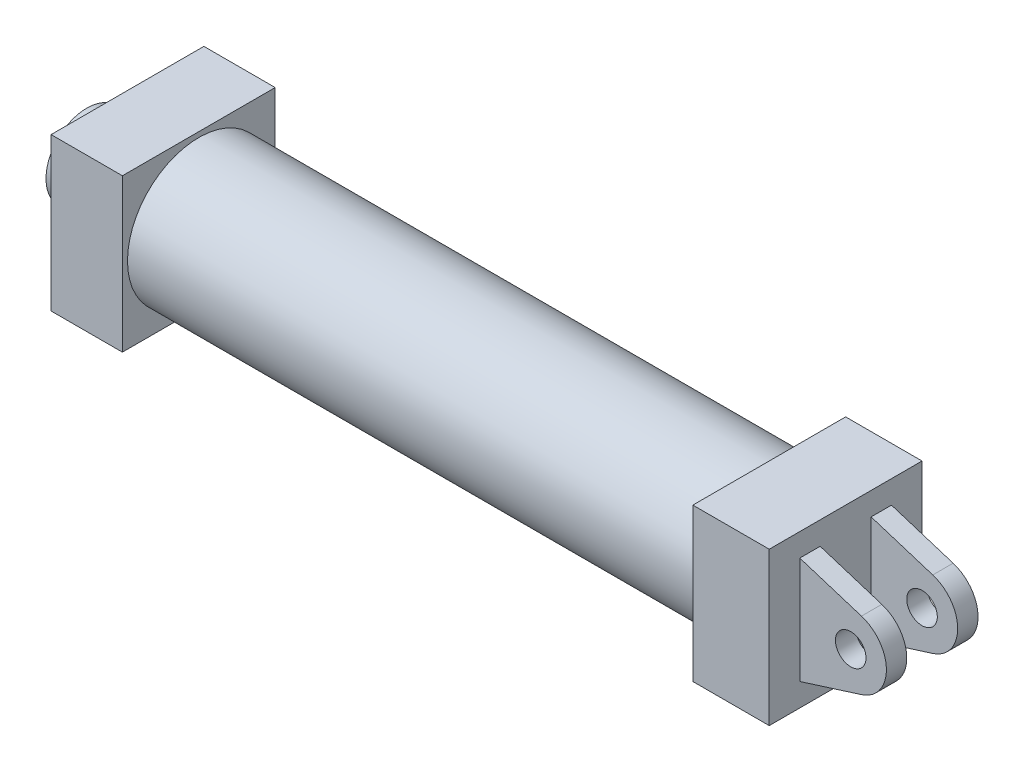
ISO-10303-21;
HEADER;
FILE_DESCRIPTION(('STEP AP214'),'2;1');
FILE_NAME('part.step','',(''),(''),'','','');
FILE_SCHEMA(('AUTOMOTIVE_DESIGN { 1 0 10303 214 1 1 1 1 }'));
ENDSEC;
DATA;
#1=APPLICATION_CONTEXT('core data for automotive mechanical design processes');
#2=APPLICATION_PROTOCOL_DEFINITION('international standard','automotive_design',2000,#1);
#3=PRODUCT_CONTEXT('',#1,'mechanical');
#4=PRODUCT('Part','Part','',(#3));
#5=PRODUCT_RELATED_PRODUCT_CATEGORY('part','',(#4));
#6=PRODUCT_DEFINITION_FORMATION('','',#4);
#7=PRODUCT_DEFINITION_CONTEXT('part definition',#1,'design');
#8=PRODUCT_DEFINITION('design','',#6,#7);
#9=PRODUCT_DEFINITION_SHAPE('','',#8);
#10=(LENGTH_UNIT() NAMED_UNIT(*) SI_UNIT(.MILLI.,.METRE.));
#11=(NAMED_UNIT(*) PLANE_ANGLE_UNIT() SI_UNIT($,.RADIAN.));
#12=(NAMED_UNIT(*) SI_UNIT($,.STERADIAN.) SOLID_ANGLE_UNIT());
#13=UNCERTAINTY_MEASURE_WITH_UNIT(LENGTH_MEASURE(1.E-05),#10,'distance_accuracy_value','');
#14=(GEOMETRIC_REPRESENTATION_CONTEXT(3) GLOBAL_UNCERTAINTY_ASSIGNED_CONTEXT((#13)) GLOBAL_UNIT_ASSIGNED_CONTEXT((#10,
#11,#12)) REPRESENTATION_CONTEXT('',''));
#15=CARTESIAN_POINT('',(0.,0.,0.));
#16=DIRECTION('',(0.,0.,1.));
#17=DIRECTION('',(1.,0.,0.));
#18=AXIS2_PLACEMENT_3D('',#15,#16,#17);
#19=CARTESIAN_POINT('',(31.75,0.,28.575));
#20=DIRECTION('',(0.,0.,-1.));
#21=DIRECTION('',(-1.,0.,0.));
#22=AXIS2_PLACEMENT_3D('',#19,#20,#21);
#23=CYLINDRICAL_SURFACE('',#22,22.225);
#24=DIRECTION('',(0.,0.,-1.));
#25=VECTOR('',#24,1.);
#26=CARTESIAN_POINT('',(38.4331863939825,-21.1963592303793,28.575));
#27=LINE('',#26,#25);
#28=CARTESIAN_POINT('',(38.4331863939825,-21.1963592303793,28.575));
#29=VERTEX_POINT('',#28);
#30=CARTESIAN_POINT('',(38.4331863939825,-21.1963592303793,15.875));
#31=VERTEX_POINT('',#30);
#32=EDGE_CURVE('E163',#29,#31,#27,.T.);
#33=ORIENTED_EDGE('',*,*,#32,.T.);
#34=CARTESIAN_POINT('',(31.75,0.,15.875));
#35=DIRECTION('',(0.,0.,-1.));
#36=DIRECTION('',(0.,1.,0.));
#37=AXIS2_PLACEMENT_3D('',#34,#35,#36);
#38=CIRCLE('',#37,22.225);
#39=CARTESIAN_POINT('',(38.4331863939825,21.1963592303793,15.875));
#40=VERTEX_POINT('',#39);
#41=EDGE_CURVE('E45',#40,#31,#38,.T.);
#42=ORIENTED_EDGE('',*,*,#41,.F.);
#43=DIRECTION('',(0.,0.,-1.));
#44=VECTOR('',#43,1.);
#45=CARTESIAN_POINT('',(38.4331863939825,21.1963592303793,28.575));
#46=LINE('',#45,#44);
#47=CARTESIAN_POINT('',(38.4331863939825,21.1963592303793,28.575));
#48=VERTEX_POINT('',#47);
#49=EDGE_CURVE('E168',#48,#40,#46,.T.);
#50=ORIENTED_EDGE('',*,*,#49,.F.);
#51=CARTESIAN_POINT('',(31.75,0.,28.575));
#52=DIRECTION('',(0.,0.,1.));
#53=DIRECTION('',(1.,0.,0.));
#54=AXIS2_PLACEMENT_3D('',#51,#52,#53);
#55=CIRCLE('',#54,22.225);
#56=EDGE_CURVE('E283',#29,#48,#55,.T.);
#57=ORIENTED_EDGE('',*,*,#56,.F.);
#58=EDGE_LOOP('',(#33,#42,#50,#57));
#59=FACE_BOUND('',#58,.T.);
#60=ADVANCED_FACE('F28',(#59),#23,.T.);
#61=CARTESIAN_POINT('',(38.4331863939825,21.1963592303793,28.575));
#62=DIRECTION('',(-0.300705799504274,-0.953716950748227,0.));
#63=DIRECTION('',(0.953716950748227,-0.300705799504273,0.));
#64=AXIS2_PLACEMENT_3D('',#61,#62,#63);
#65=PLANE('',#64);
#66=DIRECTION('',(0.953716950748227,-0.300705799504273,0.));
#67=VECTOR('',#66,1.);
#68=CARTESIAN_POINT('',(38.4331863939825,21.1963592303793,15.875));
#69=LINE('',#68,#67);
#70=CARTESIAN_POINT('',(0.,33.3142963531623,15.875));
#71=VERTEX_POINT('',#70);
#72=EDGE_CURVE('E255',#71,#40,#69,.T.);
#73=ORIENTED_EDGE('',*,*,#72,.F.);
#74=DIRECTION('',(0.,0.,-1.));
#75=VECTOR('',#74,1.);
#76=CARTESIAN_POINT('',(0.,33.3142963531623,28.575));
#77=LINE('',#76,#75);
#78=CARTESIAN_POINT('',(0.,33.3142963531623,28.575));
#79=VERTEX_POINT('',#78);
#80=EDGE_CURVE('E155',#79,#71,#77,.T.);
#81=ORIENTED_EDGE('',*,*,#80,.F.);
#82=DIRECTION('',(-0.953716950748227,0.300705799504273,0.));
#83=VECTOR('',#82,1.);
#84=CARTESIAN_POINT('',(38.4331863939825,21.1963592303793,28.575));
#85=LINE('',#84,#83);
#86=EDGE_CURVE('E286',#48,#79,#85,.T.);
#87=ORIENTED_EDGE('',*,*,#86,.F.);
#88=ORIENTED_EDGE('',*,*,#49,.T.);
#89=EDGE_LOOP('',(#73,#81,#87,#88));
#90=FACE_BOUND('',#89,.T.);
#91=ADVANCED_FACE('F300',(#90),#65,.F.);
#92=CARTESIAN_POINT('',(38.4331863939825,-21.1963592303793,28.575));
#93=DIRECTION('',(0.300705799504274,-0.953716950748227,0.));
#94=DIRECTION('',(0.953716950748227,0.300705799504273,0.));
#95=AXIS2_PLACEMENT_3D('',#92,#93,#94);
#96=PLANE('',#95);
#97=DIRECTION('',(0.,0.,-1.));
#98=VECTOR('',#97,1.);
#99=CARTESIAN_POINT('',(0.,-33.3142963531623,28.575));
#100=LINE('',#99,#98);
#101=CARTESIAN_POINT('',(0.,-33.3142963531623,28.575));
#102=VERTEX_POINT('',#101);
#103=CARTESIAN_POINT('',(0.,-33.3142963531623,15.875));
#104=VERTEX_POINT('',#103);
#105=EDGE_CURVE('E153',#102,#104,#100,.T.);
#106=ORIENTED_EDGE('',*,*,#105,.T.);
#107=DIRECTION('',(0.953716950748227,0.300705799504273,0.));
#108=VECTOR('',#107,1.);
#109=CARTESIAN_POINT('',(38.4331863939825,-21.1963592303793,15.875));
#110=LINE('',#109,#108);
#111=EDGE_CURVE('E140',#104,#31,#110,.T.);
#112=ORIENTED_EDGE('',*,*,#111,.T.);
#113=ORIENTED_EDGE('',*,*,#32,.F.);
#114=DIRECTION('',(-0.953716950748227,-0.300705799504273,0.));
#115=VECTOR('',#114,1.);
#116=CARTESIAN_POINT('',(38.4331863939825,-21.1963592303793,28.575));
#117=LINE('',#116,#115);
#118=EDGE_CURVE('E53',#29,#102,#117,.T.);
#119=ORIENTED_EDGE('',*,*,#118,.T.);
#120=EDGE_LOOP('',(#106,#112,#113,#119));
#121=FACE_BOUND('',#120,.T.);
#122=ADVANCED_FACE('F158',(#121),#96,.T.);
#123=CARTESIAN_POINT('',(31.75,0.,28.575));
#124=DIRECTION('',(0.,0.,-1.));
#125=DIRECTION('',(-1.,0.,0.));
#126=AXIS2_PLACEMENT_3D('',#123,#124,#125);
#127=CYLINDRICAL_SURFACE('',#126,9.525);
#128=CARTESIAN_POINT('',(31.75,0.,28.575));
#129=DIRECTION('',(0.,0.,1.));
#130=DIRECTION('',(1.,0.,0.));
#131=AXIS2_PLACEMENT_3D('',#128,#129,#130);
#132=CIRCLE('',#131,9.525);
#133=CARTESIAN_POINT('',(41.275,0.,28.575));
#134=VERTEX_POINT('',#133);
#135=EDGE_CURVE('E268',#134,#134,#132,.T.);
#136=ORIENTED_EDGE('',*,*,#135,.T.);
#137=EDGE_LOOP('',(#136));
#138=FACE_BOUND('',#137,.T.);
#139=CARTESIAN_POINT('',(31.75,0.,15.875));
#140=DIRECTION('',(0.,0.,-1.));
#141=DIRECTION('',(0.,1.,0.));
#142=AXIS2_PLACEMENT_3D('',#139,#140,#141);
#143=CIRCLE('',#142,9.525);
#144=CARTESIAN_POINT('',(31.75,9.525,15.875));
#145=VERTEX_POINT('',#144);
#146=EDGE_CURVE('E146',#145,#145,#143,.T.);
#147=ORIENTED_EDGE('',*,*,#146,.T.);
#148=EDGE_LOOP('',(#147));
#149=FACE_BOUND('',#148,.T.);
#150=ADVANCED_FACE('F308',(#138,#149),#127,.F.);
#151=CARTESIAN_POINT('',(0.,-47.625,47.625));
#152=DIRECTION('',(-1.,0.,0.));
#153=DIRECTION('',(0.,0.,1.));
#154=AXIS2_PLACEMENT_3D('',#151,#152,#153);
#155=PLANE('',#154);
#156=DIRECTION('',(0.,1.,0.));
#157=VECTOR('',#156,1.);
#158=CARTESIAN_POINT('',(0.,-47.625,-15.875));
#159=LINE('',#158,#157);
#160=CARTESIAN_POINT('',(0.,-33.3142963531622,-15.875));
#161=VERTEX_POINT('',#160);
#162=CARTESIAN_POINT('',(0.,33.3142963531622,-15.875));
#163=VERTEX_POINT('',#162);
#164=EDGE_CURVE('E156',#161,#163,#159,.T.);
#165=ORIENTED_EDGE('',*,*,#164,.T.);
#166=CARTESIAN_POINT('',(0.,33.3142963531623,-28.575));
#167=VERTEX_POINT('',#166);
#168=EDGE_CURVE('E159',#163,#167,#77,.T.);
#169=ORIENTED_EDGE('',*,*,#168,.T.);
#170=DIRECTION('',(0.,-1.,0.));
#171=VECTOR('',#170,1.);
#172=CARTESIAN_POINT('',(0.,33.3142963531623,-28.575));
#173=LINE('',#172,#171);
#174=CARTESIAN_POINT('',(0.,-33.3142963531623,-28.575));
#175=VERTEX_POINT('',#174);
#176=EDGE_CURVE('E277',#167,#175,#173,.T.);
#177=ORIENTED_EDGE('',*,*,#176,.T.);
#178=EDGE_CURVE('E160',#161,#175,#100,.T.);
#179=ORIENTED_EDGE('',*,*,#178,.F.);
#180=EDGE_LOOP('',(#165,#169,#177,#179));
#181=FACE_BOUND('',#180,.T.);
#182=DIRECTION('',(0.,1.,0.));
#183=VECTOR('',#182,1.);
#184=CARTESIAN_POINT('',(0.,-47.625,-47.625));
#185=LINE('',#184,#183);
#186=CARTESIAN_POINT('',(0.,-47.625,-47.625));
#187=VERTEX_POINT('',#186);
#188=CARTESIAN_POINT('',(0.,47.625,-47.625));
#189=VERTEX_POINT('',#188);
#190=EDGE_CURVE('E224',#187,#189,#185,.T.);
#191=ORIENTED_EDGE('',*,*,#190,.T.);
#192=DIRECTION('',(0.,0.,-1.));
#193=VECTOR('',#192,1.);
#194=CARTESIAN_POINT('',(0.,47.625,47.625));
#195=LINE('',#194,#193);
#196=CARTESIAN_POINT('',(0.,47.625,47.625));
#197=VERTEX_POINT('',#196);
#198=EDGE_CURVE('E227',#197,#189,#195,.T.);
#199=ORIENTED_EDGE('',*,*,#198,.F.);
#200=DIRECTION('',(0.,-1.,0.));
#201=VECTOR('',#200,1.);
#202=CARTESIAN_POINT('',(0.,47.625,47.625));
#203=LINE('',#202,#201);
#204=CARTESIAN_POINT('',(0.,-47.625,47.625));
#205=VERTEX_POINT('',#204);
#206=EDGE_CURVE('E219',#197,#205,#203,.T.);
#207=ORIENTED_EDGE('',*,*,#206,.T.);
#208=DIRECTION('',(0.,0.,1.));
#209=VECTOR('',#208,1.);
#210=CARTESIAN_POINT('',(0.,-47.625,-47.625));
#211=LINE('',#210,#209);
#212=EDGE_CURVE('E222',#187,#205,#211,.T.);
#213=ORIENTED_EDGE('',*,*,#212,.F.);
#214=EDGE_LOOP('',(#191,#199,#207,#213));
#215=FACE_BOUND('',#214,.T.);
#216=ORIENTED_EDGE('',*,*,#80,.T.);
#217=DIRECTION('',(0.,1.,0.));
#218=VECTOR('',#217,1.);
#219=CARTESIAN_POINT('',(0.,-47.625,15.875));
#220=LINE('',#219,#218);
#221=EDGE_CURVE('E143',#104,#71,#220,.T.);
#222=ORIENTED_EDGE('',*,*,#221,.F.);
#223=ORIENTED_EDGE('',*,*,#105,.F.);
#224=DIRECTION('',(0.,-1.,0.));
#225=VECTOR('',#224,1.);
#226=CARTESIAN_POINT('',(0.,33.3142963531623,28.575));
#227=LINE('',#226,#225);
#228=EDGE_CURVE('E288',#79,#102,#227,.T.);
#229=ORIENTED_EDGE('',*,*,#228,.F.);
#230=EDGE_LOOP('',(#216,#222,#223,#229));
#231=FACE_BOUND('',#230,.T.);
#232=ADVANCED_FACE('F151',(#181,#215,#231),#155,.F.);
#233=CARTESIAN_POINT('',(-447.675,-47.625,47.625));
#234=DIRECTION('',(-1.,0.,0.));
#235=DIRECTION('',(0.,0.,1.));
#236=AXIS2_PLACEMENT_3D('',#233,#234,#235);
#237=PLANE('',#236);
#238=DIRECTION('',(0.,0.,1.));
#239=VECTOR('',#238,1.);
#240=CARTESIAN_POINT('',(-447.675,-47.625,-47.625));
#241=LINE('',#240,#239);
#242=CARTESIAN_POINT('',(-447.675,-47.625,-47.625));
#243=VERTEX_POINT('',#242);
#244=CARTESIAN_POINT('',(-447.675,-47.625,47.625));
#245=VERTEX_POINT('',#244);
#246=EDGE_CURVE('E192',#243,#245,#241,.T.);
#247=ORIENTED_EDGE('',*,*,#246,.T.);
#248=DIRECTION('',(0.,1.,0.));
#249=VECTOR('',#248,1.);
#250=CARTESIAN_POINT('',(-447.675,-47.625,47.625));
#251=LINE('',#250,#249);
#252=CARTESIAN_POINT('',(-447.675,47.625,47.625));
#253=VERTEX_POINT('',#252);
#254=EDGE_CURVE('E195',#245,#253,#251,.T.);
#255=ORIENTED_EDGE('',*,*,#254,.T.);
#256=DIRECTION('',(0.,0.,-1.));
#257=VECTOR('',#256,1.);
#258=CARTESIAN_POINT('',(-447.675,47.625,47.625));
#259=LINE('',#258,#257);
#260=CARTESIAN_POINT('',(-447.675,47.625,-47.625));
#261=VERTEX_POINT('',#260);
#262=EDGE_CURVE('E197',#253,#261,#259,.T.);
#263=ORIENTED_EDGE('',*,*,#262,.T.);
#264=DIRECTION('',(0.,-1.,0.));
#265=VECTOR('',#264,1.);
#266=CARTESIAN_POINT('',(-447.675,47.625,-47.625));
#267=LINE('',#266,#265);
#268=EDGE_CURVE('E199',#261,#243,#267,.T.);
#269=ORIENTED_EDGE('',*,*,#268,.T.);
#270=EDGE_LOOP('',(#247,#255,#263,#269));
#271=FACE_BOUND('',#270,.T.);
#272=CARTESIAN_POINT('',(-447.675,0.,0.));
#273=DIRECTION('',(-1.,0.,0.));
#274=DIRECTION('',(0.,0.,1.));
#275=AXIS2_PLACEMENT_3D('',#272,#273,#274);
#276=CIRCLE('',#275,25.4);
#277=CARTESIAN_POINT('',(-447.675,0.,25.4));
#278=VERTEX_POINT('',#277);
#279=EDGE_CURVE('E177',#278,#278,#276,.T.);
#280=ORIENTED_EDGE('',*,*,#279,.F.);
#281=EDGE_LOOP('',(#280));
#282=FACE_BOUND('',#281,.T.);
#283=ADVANCED_FACE('F377',(#271,#282),#237,.T.);
#284=CARTESIAN_POINT('',(-47.625,-47.625,47.625));
#285=DIRECTION('',(-1.,0.,0.));
#286=DIRECTION('',(0.,0.,1.));
#287=AXIS2_PLACEMENT_3D('',#284,#285,#286);
#288=PLANE('',#287);
#289=DIRECTION('',(0.,-1.,0.));
#290=VECTOR('',#289,1.);
#291=CARTESIAN_POINT('',(-47.625,47.625,47.625));
#292=LINE('',#291,#290);
#293=CARTESIAN_POINT('',(-47.625,47.625,47.625));
#294=VERTEX_POINT('',#293);
#295=CARTESIAN_POINT('',(-47.625,-47.625,47.625));
#296=VERTEX_POINT('',#295);
#297=EDGE_CURVE('E229',#294,#296,#292,.T.);
#298=ORIENTED_EDGE('',*,*,#297,.F.);
#299=DIRECTION('',(0.,0.,-1.));
#300=VECTOR('',#299,1.);
#301=CARTESIAN_POINT('',(-47.625,47.625,47.625));
#302=LINE('',#301,#300);
#303=CARTESIAN_POINT('',(-47.625,47.625,-47.625));
#304=VERTEX_POINT('',#303);
#305=EDGE_CURVE('E237',#294,#304,#302,.T.);
#306=ORIENTED_EDGE('',*,*,#305,.T.);
#307=DIRECTION('',(0.,1.,0.));
#308=VECTOR('',#307,1.);
#309=CARTESIAN_POINT('',(-47.625,-47.625,-47.625));
#310=LINE('',#309,#308);
#311=CARTESIAN_POINT('',(-47.625,-47.625,-47.625));
#312=VERTEX_POINT('',#311);
#313=EDGE_CURVE('E234',#312,#304,#310,.T.);
#314=ORIENTED_EDGE('',*,*,#313,.F.);
#315=DIRECTION('',(0.,0.,1.));
#316=VECTOR('',#315,1.);
#317=CARTESIAN_POINT('',(-47.625,-47.625,-47.625));
#318=LINE('',#317,#316);
#319=EDGE_CURVE('E232',#312,#296,#318,.T.);
#320=ORIENTED_EDGE('',*,*,#319,.T.);
#321=EDGE_LOOP('',(#298,#306,#314,#320));
#322=FACE_BOUND('',#321,.T.);
#323=CARTESIAN_POINT('',(-47.625,0.,0.));
#324=DIRECTION('',(-1.,0.,0.));
#325=DIRECTION('',(0.,0.,1.));
#326=AXIS2_PLACEMENT_3D('',#323,#324,#325);
#327=CIRCLE('',#326,44.45);
#328=CARTESIAN_POINT('',(-47.625,0.,44.45));
#329=VERTEX_POINT('',#328);
#330=EDGE_CURVE('E213',#329,#329,#327,.T.);
#331=ORIENTED_EDGE('',*,*,#330,.F.);
#332=EDGE_LOOP('',(#331));
#333=FACE_BOUND('',#332,.T.);
#334=ADVANCED_FACE('F380',(#322,#333),#288,.T.);
#335=CARTESIAN_POINT('',(-47.625,47.625,47.625));
#336=DIRECTION('',(0.,0.,1.));
#337=DIRECTION('',(0.,-1.,0.));
#338=AXIS2_PLACEMENT_3D('',#335,#336,#337);
#339=PLANE('',#338);
#340=ORIENTED_EDGE('',*,*,#206,.F.);
#341=DIRECTION('',(1.,0.,0.));
#342=VECTOR('',#341,1.);
#343=CARTESIAN_POINT('',(-47.625,47.625,47.625));
#344=LINE('',#343,#342);
#345=EDGE_CURVE('E11',#294,#197,#344,.T.);
#346=ORIENTED_EDGE('',*,*,#345,.F.);
#347=ORIENTED_EDGE('',*,*,#297,.T.);
#348=DIRECTION('',(1.,0.,0.));
#349=VECTOR('',#348,1.);
#350=CARTESIAN_POINT('',(-47.625,-47.625,47.625));
#351=LINE('',#350,#349);
#352=EDGE_CURVE('E238',#296,#205,#351,.T.);
#353=ORIENTED_EDGE('',*,*,#352,.T.);
#354=EDGE_LOOP('',(#340,#346,#347,#353));
#355=FACE_BOUND('',#354,.T.);
#356=ADVANCED_FACE('F30',(#355),#339,.T.);
#357=CARTESIAN_POINT('',(-47.625,47.625,47.625));
#358=DIRECTION('',(0.,-1.,0.));
#359=DIRECTION('',(0.,0.,-1.));
#360=AXIS2_PLACEMENT_3D('',#357,#358,#359);
#361=PLANE('',#360);
#362=ORIENTED_EDGE('',*,*,#198,.T.);
#363=DIRECTION('',(1.,0.,0.));
#364=VECTOR('',#363,1.);
#365=CARTESIAN_POINT('',(-47.625,47.625,-47.625));
#366=LINE('',#365,#364);
#367=EDGE_CURVE('E37',#304,#189,#366,.T.);
#368=ORIENTED_EDGE('',*,*,#367,.F.);
#369=ORIENTED_EDGE('',*,*,#305,.F.);
#370=ORIENTED_EDGE('',*,*,#345,.T.);
#371=EDGE_LOOP('',(#362,#368,#369,#370));
#372=FACE_BOUND('',#371,.T.);
#373=ADVANCED_FACE('F405',(#372),#361,.F.);
#374=CARTESIAN_POINT('',(-47.625,-47.625,-47.625));
#375=DIRECTION('',(0.,0.,-1.));
#376=DIRECTION('',(0.,1.,0.));
#377=AXIS2_PLACEMENT_3D('',#374,#375,#376);
#378=PLANE('',#377);
#379=ORIENTED_EDGE('',*,*,#190,.F.);
#380=DIRECTION('',(1.,0.,0.));
#381=VECTOR('',#380,1.);
#382=CARTESIAN_POINT('',(-47.625,-47.625,-47.625));
#383=LINE('',#382,#381);
#384=EDGE_CURVE('E242',#312,#187,#383,.T.);
#385=ORIENTED_EDGE('',*,*,#384,.F.);
#386=ORIENTED_EDGE('',*,*,#313,.T.);
#387=ORIENTED_EDGE('',*,*,#367,.T.);
#388=EDGE_LOOP('',(#379,#385,#386,#387));
#389=FACE_BOUND('',#388,.T.);
#390=ADVANCED_FACE('F408',(#389),#378,.T.);
#391=CARTESIAN_POINT('',(-47.625,-47.625,-47.625));
#392=DIRECTION('',(0.,1.,0.));
#393=DIRECTION('',(0.,0.,1.));
#394=AXIS2_PLACEMENT_3D('',#391,#392,#393);
#395=PLANE('',#394);
#396=ORIENTED_EDGE('',*,*,#212,.T.);
#397=ORIENTED_EDGE('',*,*,#352,.F.);
#398=ORIENTED_EDGE('',*,*,#319,.F.);
#399=ORIENTED_EDGE('',*,*,#384,.T.);
#400=EDGE_LOOP('',(#396,#397,#398,#399));
#401=FACE_BOUND('',#400,.T.);
#402=ADVANCED_FACE('F398',(#401),#395,.F.);
#403=CARTESIAN_POINT('',(-403.225,0.,0.));
#404=DIRECTION('',(1.,0.,0.));
#405=DIRECTION('',(0.,0.,-1.));
#406=AXIS2_PLACEMENT_3D('',#403,#404,#405);
#407=CYLINDRICAL_SURFACE('',#406,44.45);
#408=CARTESIAN_POINT('',(-403.225,0.,0.));
#409=DIRECTION('',(-1.,0.,0.));
#410=DIRECTION('',(0.,0.,1.));
#411=AXIS2_PLACEMENT_3D('',#408,#409,#410);
#412=CIRCLE('',#411,44.45);
#413=CARTESIAN_POINT('',(-403.225,0.,44.45));
#414=VERTEX_POINT('',#413);
#415=EDGE_CURVE('E216',#414,#414,#412,.T.);
#416=ORIENTED_EDGE('',*,*,#415,.F.);
#417=EDGE_LOOP('',(#416));
#418=FACE_BOUND('',#417,.T.);
#419=ORIENTED_EDGE('',*,*,#330,.T.);
#420=EDGE_LOOP('',(#419));
#421=FACE_BOUND('',#420,.T.);
#422=ADVANCED_FACE('F375',(#418,#421),#407,.T.);
#423=CARTESIAN_POINT('',(-403.225,-47.625,47.625));
#424=DIRECTION('',(-1.,0.,0.));
#425=DIRECTION('',(0.,0.,1.));
#426=AXIS2_PLACEMENT_3D('',#423,#424,#425);
#427=PLANE('',#426);
#428=DIRECTION('',(0.,0.,1.));
#429=VECTOR('',#428,1.);
#430=CARTESIAN_POINT('',(-403.225,-47.625,-47.625));
#431=LINE('',#430,#429);
#432=CARTESIAN_POINT('',(-403.225,-47.625,-47.625));
#433=VERTEX_POINT('',#432);
#434=CARTESIAN_POINT('',(-403.225,-47.625,47.625));
#435=VERTEX_POINT('',#434);
#436=EDGE_CURVE('E183',#433,#435,#431,.T.);
#437=ORIENTED_EDGE('',*,*,#436,.F.);
#438=DIRECTION('',(0.,-1.,0.));
#439=VECTOR('',#438,1.);
#440=CARTESIAN_POINT('',(-403.225,47.625,-47.625));
#441=LINE('',#440,#439);
#442=CARTESIAN_POINT('',(-403.225,47.625,-47.625));
#443=VERTEX_POINT('',#442);
#444=EDGE_CURVE('E190',#443,#433,#441,.T.);
#445=ORIENTED_EDGE('',*,*,#444,.F.);
#446=DIRECTION('',(0.,0.,-1.));
#447=VECTOR('',#446,1.);
#448=CARTESIAN_POINT('',(-403.225,47.625,47.625));
#449=LINE('',#448,#447);
#450=CARTESIAN_POINT('',(-403.225,47.625,47.625));
#451=VERTEX_POINT('',#450);
#452=EDGE_CURVE('E188',#451,#443,#449,.T.);
#453=ORIENTED_EDGE('',*,*,#452,.F.);
#454=DIRECTION('',(0.,1.,0.));
#455=VECTOR('',#454,1.);
#456=CARTESIAN_POINT('',(-403.225,-47.625,47.625));
#457=LINE('',#456,#455);
#458=EDGE_CURVE('E186',#435,#451,#457,.T.);
#459=ORIENTED_EDGE('',*,*,#458,.F.);
#460=EDGE_LOOP('',(#437,#445,#453,#459));
#461=FACE_BOUND('',#460,.T.);
#462=ORIENTED_EDGE('',*,*,#415,.T.);
#463=EDGE_LOOP('',(#462));
#464=FACE_BOUND('',#463,.T.);
#465=ADVANCED_FACE('F371',(#461,#464),#427,.F.);
#466=CARTESIAN_POINT('',(-447.675,-47.625,-47.625));
#467=DIRECTION('',(0.,1.,0.));
#468=DIRECTION('',(0.,0.,1.));
#469=AXIS2_PLACEMENT_3D('',#466,#467,#468);
#470=PLANE('',#469);
#471=ORIENTED_EDGE('',*,*,#436,.T.);
#472=DIRECTION('',(1.,0.,0.));
#473=VECTOR('',#472,1.);
#474=CARTESIAN_POINT('',(-447.675,-47.625,47.625));
#475=LINE('',#474,#473);
#476=EDGE_CURVE('E210',#245,#435,#475,.T.);
#477=ORIENTED_EDGE('',*,*,#476,.F.);
#478=ORIENTED_EDGE('',*,*,#246,.F.);
#479=DIRECTION('',(1.,0.,0.));
#480=VECTOR('',#479,1.);
#481=CARTESIAN_POINT('',(-447.675,-47.625,-47.625));
#482=LINE('',#481,#480);
#483=EDGE_CURVE('E201',#243,#433,#482,.T.);
#484=ORIENTED_EDGE('',*,*,#483,.T.);
#485=EDGE_LOOP('',(#471,#477,#478,#484));
#486=FACE_BOUND('',#485,.T.);
#487=ADVANCED_FACE('F374',(#486),#470,.F.);
#488=CARTESIAN_POINT('',(-447.675,-47.625,47.625));
#489=DIRECTION('',(0.,0.,-1.));
#490=DIRECTION('',(0.,1.,0.));
#491=AXIS2_PLACEMENT_3D('',#488,#489,#490);
#492=PLANE('',#491);
#493=ORIENTED_EDGE('',*,*,#458,.T.);
#494=DIRECTION('',(1.,0.,0.));
#495=VECTOR('',#494,1.);
#496=CARTESIAN_POINT('',(-447.675,47.625,47.625));
#497=LINE('',#496,#495);
#498=EDGE_CURVE('E207',#253,#451,#497,.T.);
#499=ORIENTED_EDGE('',*,*,#498,.F.);
#500=ORIENTED_EDGE('',*,*,#254,.F.);
#501=ORIENTED_EDGE('',*,*,#476,.T.);
#502=EDGE_LOOP('',(#493,#499,#500,#501));
#503=FACE_BOUND('',#502,.T.);
#504=ADVANCED_FACE('F388',(#503),#492,.F.);
#505=CARTESIAN_POINT('',(-447.675,47.625,47.625));
#506=DIRECTION('',(0.,-1.,0.));
#507=DIRECTION('',(0.,0.,-1.));
#508=AXIS2_PLACEMENT_3D('',#505,#506,#507);
#509=PLANE('',#508);
#510=ORIENTED_EDGE('',*,*,#452,.T.);
#511=DIRECTION('',(1.,0.,0.));
#512=VECTOR('',#511,1.);
#513=CARTESIAN_POINT('',(-447.675,47.625,-47.625));
#514=LINE('',#513,#512);
#515=EDGE_CURVE('E204',#261,#443,#514,.T.);
#516=ORIENTED_EDGE('',*,*,#515,.F.);
#517=ORIENTED_EDGE('',*,*,#262,.F.);
#518=ORIENTED_EDGE('',*,*,#498,.T.);
#519=EDGE_LOOP('',(#510,#516,#517,#518));
#520=FACE_BOUND('',#519,.T.);
#521=ADVANCED_FACE('F384',(#520),#509,.F.);
#522=CARTESIAN_POINT('',(-447.675,47.625,-47.625));
#523=DIRECTION('',(0.,0.,1.));
#524=DIRECTION('',(0.,-1.,0.));
#525=AXIS2_PLACEMENT_3D('',#522,#523,#524);
#526=PLANE('',#525);
#527=ORIENTED_EDGE('',*,*,#444,.T.);
#528=ORIENTED_EDGE('',*,*,#483,.F.);
#529=ORIENTED_EDGE('',*,*,#268,.F.);
#530=ORIENTED_EDGE('',*,*,#515,.T.);
#531=EDGE_LOOP('',(#527,#528,#529,#530));
#532=FACE_BOUND('',#531,.T.);
#533=ADVANCED_FACE('F369',(#532),#526,.F.);
#534=CARTESIAN_POINT('',(-473.075,0.,0.));
#535=DIRECTION('',(1.,0.,0.));
#536=DIRECTION('',(0.,0.,-1.));
#537=AXIS2_PLACEMENT_3D('',#534,#535,#536);
#538=CYLINDRICAL_SURFACE('',#537,25.4);
#539=CARTESIAN_POINT('',(-473.075,0.,0.));
#540=DIRECTION('',(-1.,0.,0.));
#541=DIRECTION('',(0.,0.,1.));
#542=AXIS2_PLACEMENT_3D('',#539,#540,#541);
#543=CIRCLE('',#542,25.4);
#544=CARTESIAN_POINT('',(-473.075,0.,25.4));
#545=VERTEX_POINT('',#544);
#546=EDGE_CURVE('E180',#545,#545,#543,.T.);
#547=ORIENTED_EDGE('',*,*,#546,.F.);
#548=EDGE_LOOP('',(#547));
#549=FACE_BOUND('',#548,.T.);
#550=ORIENTED_EDGE('',*,*,#279,.T.);
#551=EDGE_LOOP('',(#550));
#552=FACE_BOUND('',#551,.T.);
#553=ADVANCED_FACE('F365',(#549,#552),#538,.T.);
#554=CARTESIAN_POINT('',(-473.075,0.,0.));
#555=DIRECTION('',(-1.,0.,0.));
#556=DIRECTION('',(0.,0.,1.));
#557=AXIS2_PLACEMENT_3D('',#554,#555,#556);
#558=PLANE('',#557);
#559=CARTESIAN_POINT('',(-473.075,0.,0.));
#560=DIRECTION('',(-1.,0.,0.));
#561=DIRECTION('',(0.,0.,1.));
#562=AXIS2_PLACEMENT_3D('',#559,#560,#561);
#563=CIRCLE('',#562,17.4625);
#564=CARTESIAN_POINT('',(-473.075,0.,17.4625));
#565=VERTEX_POINT('',#564);
#566=EDGE_CURVE('E171',#565,#565,#563,.T.);
#567=ORIENTED_EDGE('',*,*,#566,.F.);
#568=EDGE_LOOP('',(#567));
#569=FACE_BOUND('',#568,.T.);
#570=ORIENTED_EDGE('',*,*,#546,.T.);
#571=EDGE_LOOP('',(#570));
#572=FACE_BOUND('',#571,.T.);
#573=ADVANCED_FACE('F358',(#569,#572),#558,.T.);
#574=CARTESIAN_POINT('',(1.76640866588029,0.,0.));
#575=DIRECTION('',(-1.,0.,0.));
#576=DIRECTION('',(0.,0.,1.));
#577=AXIS2_PLACEMENT_3D('',#574,#575,#576);
#578=CYLINDRICAL_SURFACE('',#577,17.4625);
#579=CARTESIAN_POINT('',(-47.625,0.,0.));
#580=DIRECTION('',(-1.,0.,0.));
#581=DIRECTION('',(0.,0.,1.));
#582=AXIS2_PLACEMENT_3D('',#579,#580,#581);
#583=CIRCLE('',#582,17.4625);
#584=CARTESIAN_POINT('',(-47.625,0.,17.4625));
#585=VERTEX_POINT('',#584);
#586=EDGE_CURVE('E174',#585,#585,#583,.F.);
#587=CARTESIAN_POINT('',(-47.625,0.,17.4625));
#588=CARTESIAN_POINT('',(-52.0567708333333,0.,17.4625));
#589=CARTESIAN_POINT('',(-56.4885416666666,0.,17.4625));
#590=CARTESIAN_POINT('',(-65.3520833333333,0.,17.4625));
#591=CARTESIAN_POINT('',(-69.7838541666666,0.,17.4625));
#592=CARTESIAN_POINT('',(-78.6473958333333,0.,17.4625));
#593=CARTESIAN_POINT('',(-83.0791666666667,0.,17.4625));
#594=CARTESIAN_POINT('',(-91.9427083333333,0.,17.4625));
#595=CARTESIAN_POINT('',(-96.3744791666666,0.,17.4625));
#596=CARTESIAN_POINT('',(-105.238020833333,0.,17.4625));
#597=CARTESIAN_POINT('',(-109.669791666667,0.,17.4625));
#598=CARTESIAN_POINT('',(-118.533333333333,0.,17.4625));
#599=CARTESIAN_POINT('',(-122.965104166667,0.,17.4625));
#600=CARTESIAN_POINT('',(-131.828645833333,0.,17.4625));
#601=CARTESIAN_POINT('',(-136.260416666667,0.,17.4625));
#602=CARTESIAN_POINT('',(-145.123958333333,0.,17.4625));
#603=CARTESIAN_POINT('',(-149.555729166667,0.,17.4625));
#604=CARTESIAN_POINT('',(-158.419270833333,0.,17.4625));
#605=CARTESIAN_POINT('',(-162.851041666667,0.,17.4625));
#606=CARTESIAN_POINT('',(-171.714583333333,0.,17.4625));
#607=CARTESIAN_POINT('',(-176.146354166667,0.,17.4625));
#608=CARTESIAN_POINT('',(-185.009895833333,0.,17.4625));
#609=CARTESIAN_POINT('',(-189.441666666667,0.,17.4625));
#610=CARTESIAN_POINT('',(-198.305208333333,0.,17.4625));
#611=CARTESIAN_POINT('',(-202.736979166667,0.,17.4625));
#612=CARTESIAN_POINT('',(-211.600520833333,0.,17.4625));
#613=CARTESIAN_POINT('',(-216.032291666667,0.,17.4625));
#614=CARTESIAN_POINT('',(-224.895833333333,0.,17.4625));
#615=CARTESIAN_POINT('',(-229.327604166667,0.,17.4625));
#616=CARTESIAN_POINT('',(-238.191145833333,0.,17.4625));
#617=CARTESIAN_POINT('',(-242.622916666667,0.,17.4625));
#618=CARTESIAN_POINT('',(-251.486458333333,0.,17.4625));
#619=CARTESIAN_POINT('',(-255.918229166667,0.,17.4625));
#620=CARTESIAN_POINT('',(-264.781770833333,0.,17.4625));
#621=CARTESIAN_POINT('',(-269.213541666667,0.,17.4625));
#622=CARTESIAN_POINT('',(-278.077083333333,0.,17.4625));
#623=CARTESIAN_POINT('',(-282.508854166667,0.,17.4625));
#624=CARTESIAN_POINT('',(-291.372395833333,0.,17.4625));
#625=CARTESIAN_POINT('',(-295.804166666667,0.,17.4625));
#626=CARTESIAN_POINT('',(-304.667708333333,0.,17.4625));
#627=CARTESIAN_POINT('',(-309.099479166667,0.,17.4625));
#628=CARTESIAN_POINT('',(-317.963020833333,0.,17.4625));
#629=CARTESIAN_POINT('',(-322.394791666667,0.,17.4625));
#630=CARTESIAN_POINT('',(-331.258333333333,0.,17.4625));
#631=CARTESIAN_POINT('',(-335.690104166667,0.,17.4625));
#632=CARTESIAN_POINT('',(-344.553645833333,0.,17.4625));
#633=CARTESIAN_POINT('',(-348.985416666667,0.,17.4625));
#634=CARTESIAN_POINT('',(-357.848958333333,0.,17.4625));
#635=CARTESIAN_POINT('',(-362.280729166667,0.,17.4625));
#636=CARTESIAN_POINT('',(-371.144270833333,0.,17.4625));
#637=CARTESIAN_POINT('',(-375.576041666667,0.,17.4625));
#638=CARTESIAN_POINT('',(-384.439583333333,0.,17.4625));
#639=CARTESIAN_POINT('',(-388.871354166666,0.,17.4625));
#640=CARTESIAN_POINT('',(-397.734895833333,0.,17.4625));
#641=CARTESIAN_POINT('',(-402.166666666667,0.,17.4625));
#642=CARTESIAN_POINT('',(-411.030208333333,0.,17.4625));
#643=CARTESIAN_POINT('',(-415.461979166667,0.,17.4625));
#644=CARTESIAN_POINT('',(-424.325520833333,0.,17.4625));
#645=CARTESIAN_POINT('',(-428.757291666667,0.,17.4625));
#646=CARTESIAN_POINT('',(-437.620833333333,0.,17.4625));
#647=CARTESIAN_POINT('',(-442.052604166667,0.,17.4625));
#648=CARTESIAN_POINT('',(-450.916145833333,0.,17.4625));
#649=CARTESIAN_POINT('',(-455.347916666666,0.,17.4625));
#650=CARTESIAN_POINT('',(-464.211458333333,0.,17.4625));
#651=CARTESIAN_POINT('',(-468.643229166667,0.,17.4625));
#652=CARTESIAN_POINT('',(-473.075,0.,17.4625));
#653=B_SPLINE_CURVE_WITH_KNOTS('',3,(#587,#588,#589,#590,#591,#592,#593,#594,#595,#596,#597,
#598,#599,#600,#601,#602,#603,#604,#605,#606,#607,#608,#609,#610,#611,#612,#613,#614,#615,#616,
#617,#618,#619,#620,#621,#622,#623,#624,#625,#626,#627,#628,#629,#630,#631,#632,#633,#634,#635,
#636,#637,#638,#639,#640,#641,#642,#643,#644,#645,#646,#647,#648,#649,#650,#651,#652),
.UNSPECIFIED.,.F.,.F.,(4,2,2,2,2,2,2,2,2,2,2,2,2,2,2,2,2,2,2,2,2,2,2,2,2,2,2,2,2,2,2,2,4),(0.,
13.2953125,26.590625,39.8859375,53.18125,66.4765625,79.771875,93.0671875,106.3625,119.6578125,
132.953125,146.2484375,159.54375,172.8390625,186.134375,199.4296875,212.725,226.0203125,
239.315625,252.6109375,265.90625,279.2015625,292.496875,305.7921875,319.0875,332.3828125,
345.678125,358.9734375,372.26875,385.5640625,398.859375,412.1546875,425.45),.UNSPECIFIED.);
#654=EDGE_CURVE('BSEAM352',#585,#565,#653,.T.);
#655=ORIENTED_EDGE('',*,*,#586,.T.);
#656=ORIENTED_EDGE('',*,*,#566,.T.);
#657=ORIENTED_EDGE('',*,*,#654,.T.);
#658=ORIENTED_EDGE('',*,*,#654,.F.);
#659=EDGE_LOOP('',(#655,#657,#656,#658));
#660=FACE_BOUND('',#659,.T.);
#661=ADVANCED_FACE('F352',(#660),#578,.F.);
#662=CARTESIAN_POINT('',(-47.625,-47.625,47.625));
#663=DIRECTION('',(-1.,0.,0.));
#664=DIRECTION('',(0.,0.,1.));
#665=AXIS2_PLACEMENT_3D('',#662,#663,#664);
#666=PLANE('',#665);
#667=ORIENTED_EDGE('',*,*,#586,.F.);
#668=EDGE_LOOP('',(#667));
#669=FACE_BOUND('',#668,.T.);
#670=ADVANCED_FACE('F348',(#669),#666,.T.);
#671=CARTESIAN_POINT('',(31.75,0.,28.575));
#672=DIRECTION('',(0.,0.,1.));
#673=DIRECTION('',(1.,0.,0.));
#674=AXIS2_PLACEMENT_3D('',#671,#672,#673);
#675=PLANE('',#674);
#676=ORIENTED_EDGE('',*,*,#56,.T.);
#677=ORIENTED_EDGE('',*,*,#86,.T.);
#678=ORIENTED_EDGE('',*,*,#228,.T.);
#679=ORIENTED_EDGE('',*,*,#118,.F.);
#680=EDGE_LOOP('',(#676,#677,#678,#679));
#681=FACE_BOUND('',#680,.T.);
#682=ORIENTED_EDGE('',*,*,#135,.F.);
#683=EDGE_LOOP('',(#682));
#684=FACE_BOUND('',#683,.T.);
#685=ADVANCED_FACE('F297',(#681,#684),#675,.T.);
#686=CARTESIAN_POINT('',(31.75,0.,-28.575));
#687=DIRECTION('',(0.,0.,1.));
#688=DIRECTION('',(1.,0.,0.));
#689=AXIS2_PLACEMENT_3D('',#686,#687,#688);
#690=PLANE('',#689);
#691=CARTESIAN_POINT('',(31.75,0.,-28.575));
#692=DIRECTION('',(0.,0.,1.));
#693=DIRECTION('',(1.,0.,0.));
#694=AXIS2_PLACEMENT_3D('',#691,#692,#693);
#695=CIRCLE('',#694,22.225);
#696=CARTESIAN_POINT('',(38.4331863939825,-21.1963592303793,-28.575));
#697=VERTEX_POINT('',#696);
#698=CARTESIAN_POINT('',(38.4331863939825,21.1963592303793,-28.575));
#699=VERTEX_POINT('',#698);
#700=EDGE_CURVE('E271',#697,#699,#695,.T.);
#701=ORIENTED_EDGE('',*,*,#700,.F.);
#702=DIRECTION('',(-0.953716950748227,-0.300705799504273,0.));
#703=VECTOR('',#702,1.);
#704=CARTESIAN_POINT('',(38.4331863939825,-21.1963592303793,-28.575));
#705=LINE('',#704,#703);
#706=EDGE_CURVE('E280',#697,#175,#705,.T.);
#707=ORIENTED_EDGE('',*,*,#706,.T.);
#708=ORIENTED_EDGE('',*,*,#176,.F.);
#709=DIRECTION('',(-0.953716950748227,0.300705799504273,0.));
#710=VECTOR('',#709,1.);
#711=CARTESIAN_POINT('',(38.4331863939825,21.1963592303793,-28.575));
#712=LINE('',#711,#710);
#713=EDGE_CURVE('E274',#699,#167,#712,.T.);
#714=ORIENTED_EDGE('',*,*,#713,.F.);
#715=EDGE_LOOP('',(#701,#707,#708,#714));
#716=FACE_BOUND('',#715,.T.);
#717=CARTESIAN_POINT('',(31.75,0.,-28.575));
#718=DIRECTION('',(0.,0.,1.));
#719=DIRECTION('',(1.,0.,0.));
#720=AXIS2_PLACEMENT_3D('',#717,#718,#719);
#721=CIRCLE('',#720,9.525);
#722=CARTESIAN_POINT('',(41.275,0.,-28.575));
#723=VERTEX_POINT('',#722);
#724=EDGE_CURVE('E265',#723,#723,#721,.T.);
#725=ORIENTED_EDGE('',*,*,#724,.T.);
#726=EDGE_LOOP('',(#725));
#727=FACE_BOUND('',#726,.T.);
#728=ADVANCED_FACE('F321',(#716,#727),#690,.F.);
#729=CARTESIAN_POINT('',(31.75,0.,-15.875));
#730=DIRECTION('',(0.,0.,-1.));
#731=DIRECTION('',(-1.,0.,0.));
#732=AXIS2_PLACEMENT_3D('',#729,#730,#731);
#733=CIRCLE('',#732,22.225);
#734=CARTESIAN_POINT('',(38.4331863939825,21.1963592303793,-15.875));
#735=VERTEX_POINT('',#734);
#736=CARTESIAN_POINT('',(38.4331863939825,-21.1963592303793,-15.875));
#737=VERTEX_POINT('',#736);
#738=EDGE_CURVE('E260',#735,#737,#733,.T.);
#739=ORIENTED_EDGE('',*,*,#738,.T.);
#740=EDGE_CURVE('E289',#737,#697,#27,.T.);
#741=ORIENTED_EDGE('',*,*,#740,.T.);
#742=ORIENTED_EDGE('',*,*,#700,.T.);
#743=EDGE_CURVE('E167',#735,#699,#46,.T.);
#744=ORIENTED_EDGE('',*,*,#743,.F.);
#745=EDGE_LOOP('',(#739,#741,#742,#744));
#746=FACE_BOUND('',#745,.T.);
#747=ADVANCED_FACE('F312',(#746),#23,.T.);
#748=ORIENTED_EDGE('',*,*,#168,.F.);
#749=DIRECTION('',(0.953716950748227,-0.300705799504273,0.));
#750=VECTOR('',#749,1.);
#751=CARTESIAN_POINT('',(38.4331863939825,21.1963592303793,-15.875));
#752=LINE('',#751,#750);
#753=EDGE_CURVE('E262',#163,#735,#752,.T.);
#754=ORIENTED_EDGE('',*,*,#753,.T.);
#755=ORIENTED_EDGE('',*,*,#743,.T.);
#756=ORIENTED_EDGE('',*,*,#713,.T.);
#757=EDGE_LOOP('',(#748,#754,#755,#756));
#758=FACE_BOUND('',#757,.T.);
#759=ADVANCED_FACE('F303',(#758),#65,.F.);
#760=DIRECTION('',(0.953716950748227,0.300705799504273,0.));
#761=VECTOR('',#760,1.);
#762=CARTESIAN_POINT('',(38.4331863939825,-21.1963592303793,-15.875));
#763=LINE('',#762,#761);
#764=EDGE_CURVE('E257',#161,#737,#763,.T.);
#765=ORIENTED_EDGE('',*,*,#764,.F.);
#766=ORIENTED_EDGE('',*,*,#178,.T.);
#767=ORIENTED_EDGE('',*,*,#706,.F.);
#768=ORIENTED_EDGE('',*,*,#740,.F.);
#769=EDGE_LOOP('',(#765,#766,#767,#768));
#770=FACE_BOUND('',#769,.T.);
#771=ADVANCED_FACE('F310',(#770),#96,.T.);
#772=CARTESIAN_POINT('',(31.75,0.,-15.875));
#773=DIRECTION('',(0.,0.,-1.));
#774=DIRECTION('',(-1.,0.,0.));
#775=AXIS2_PLACEMENT_3D('',#772,#773,#774);
#776=CIRCLE('',#775,9.525);
#777=CARTESIAN_POINT('',(22.225,0.,-15.875));
#778=VERTEX_POINT('',#777);
#779=EDGE_CURVE('E32',#778,#778,#776,.T.);
#780=ORIENTED_EDGE('',*,*,#779,.F.);
#781=EDGE_LOOP('',(#780));
#782=FACE_BOUND('',#781,.T.);
#783=ORIENTED_EDGE('',*,*,#724,.F.);
#784=EDGE_LOOP('',(#783));
#785=FACE_BOUND('',#784,.T.);
#786=ADVANCED_FACE('F319',(#782,#785),#127,.F.);
#787=CARTESIAN_POINT('',(53.975,-47.625,-15.875));
#788=DIRECTION('',(0.,0.,-1.));
#789=DIRECTION('',(-1.,0.,0.));
#790=AXIS2_PLACEMENT_3D('',#787,#788,#789);
#791=PLANE('',#790);
#792=ORIENTED_EDGE('',*,*,#779,.T.);
#793=EDGE_LOOP('',(#792));
#794=FACE_BOUND('',#793,.T.);
#795=ORIENTED_EDGE('',*,*,#164,.F.);
#796=ORIENTED_EDGE('',*,*,#764,.T.);
#797=ORIENTED_EDGE('',*,*,#738,.F.);
#798=ORIENTED_EDGE('',*,*,#753,.F.);
#799=EDGE_LOOP('',(#795,#796,#797,#798));
#800=FACE_BOUND('',#799,.T.);
#801=ADVANCED_FACE('F331',(#794,#800),#791,.F.);
#802=CARTESIAN_POINT('',(53.975,-47.625,15.875));
#803=DIRECTION('',(0.,0.,-1.));
#804=DIRECTION('',(0.,1.,0.));
#805=AXIS2_PLACEMENT_3D('',#802,#803,#804);
#806=PLANE('',#805);
#807=ORIENTED_EDGE('',*,*,#146,.F.);
#808=EDGE_LOOP('',(#807));
#809=FACE_BOUND('',#808,.T.);
#810=ORIENTED_EDGE('',*,*,#72,.T.);
#811=ORIENTED_EDGE('',*,*,#41,.T.);
#812=ORIENTED_EDGE('',*,*,#111,.F.);
#813=ORIENTED_EDGE('',*,*,#221,.T.);
#814=EDGE_LOOP('',(#810,#811,#812,#813));
#815=FACE_BOUND('',#814,.T.);
#816=ADVANCED_FACE('F142',(#809,#815),#806,.T.);
#817=CLOSED_SHELL('',(#60,#91,#122,#150,#232,#283,#334,#356,#373,#390,#402,#422,#465,#487,#504,
#521,#533,#553,#573,#661,#670,#685,#728,#747,#759,#771,#786,#801,#816));
#818=MANIFOLD_SOLID_BREP('B2',#817);
#819=ADVANCED_BREP_SHAPE_REPRESENTATION('',(#18,#818),#14);
#820=SHAPE_DEFINITION_REPRESENTATION(#9,#819);
ENDSEC;
END-ISO-10303-21;
